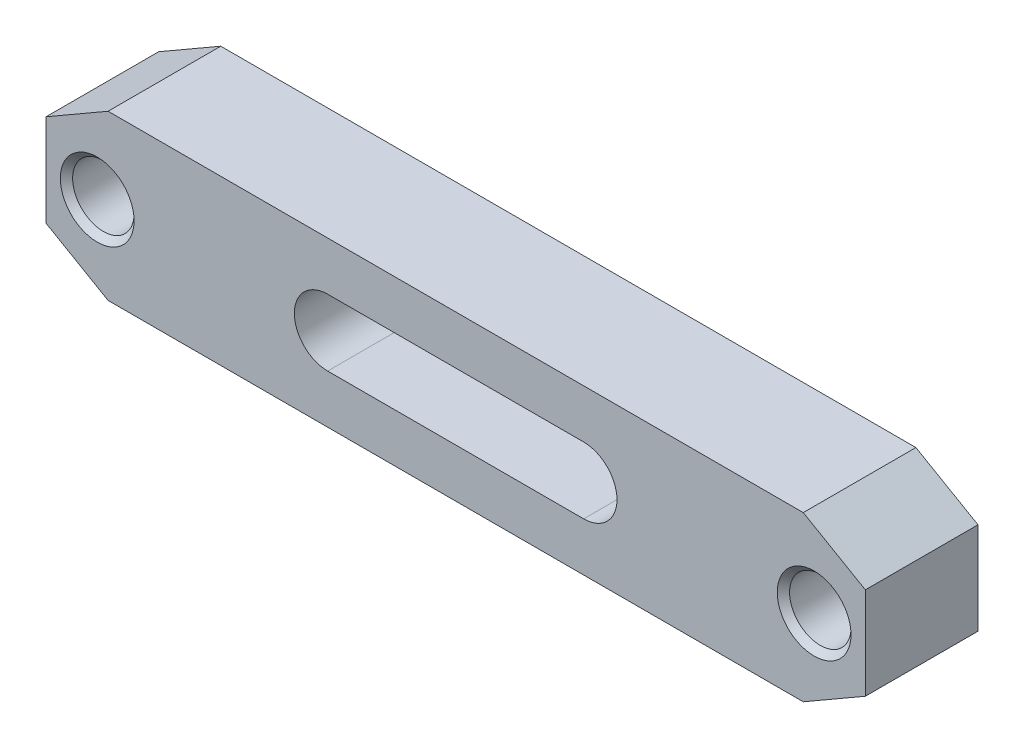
ISO-10303-21;
HEADER;
FILE_DESCRIPTION(('STEP AP214'),'2;1');
FILE_NAME('part.step','',(''),(''),'','','');
FILE_SCHEMA(('AUTOMOTIVE_DESIGN { 1 0 10303 214 1 1 1 1 }'));
ENDSEC;
DATA;
#1=APPLICATION_CONTEXT('core data for automotive mechanical design processes');
#2=APPLICATION_PROTOCOL_DEFINITION('international standard','automotive_design',2000,#1);
#3=PRODUCT_CONTEXT('',#1,'mechanical');
#4=PRODUCT('Part','Part','',(#3));
#5=PRODUCT_RELATED_PRODUCT_CATEGORY('part','',(#4));
#6=PRODUCT_DEFINITION_FORMATION('','',#4);
#7=PRODUCT_DEFINITION_CONTEXT('part definition',#1,'design');
#8=PRODUCT_DEFINITION('design','',#6,#7);
#9=PRODUCT_DEFINITION_SHAPE('','',#8);
#10=(LENGTH_UNIT() NAMED_UNIT(*) SI_UNIT(.MILLI.,.METRE.));
#11=(NAMED_UNIT(*) PLANE_ANGLE_UNIT() SI_UNIT($,.RADIAN.));
#12=(NAMED_UNIT(*) SI_UNIT($,.STERADIAN.) SOLID_ANGLE_UNIT());
#13=UNCERTAINTY_MEASURE_WITH_UNIT(LENGTH_MEASURE(1.E-05),#10,'distance_accuracy_value','');
#14=(GEOMETRIC_REPRESENTATION_CONTEXT(3) GLOBAL_UNCERTAINTY_ASSIGNED_CONTEXT((#13)) GLOBAL_UNIT_ASSIGNED_CONTEXT((#10,
#11,#12)) REPRESENTATION_CONTEXT('',''));
#15=CARTESIAN_POINT('',(0.,0.,0.));
#16=DIRECTION('',(0.,0.,1.));
#17=DIRECTION('',(1.,0.,0.));
#18=AXIS2_PLACEMENT_3D('',#15,#16,#17);
#19=CARTESIAN_POINT('',(80.,-16.,22.));
#20=DIRECTION('',(0.,0.,1.));
#21=DIRECTION('',(1.,0.,0.));
#22=AXIS2_PLACEMENT_3D('',#19,#20,#21);
#23=PLANE('',#22);
#24=CARTESIAN_POINT('',(70.,0.,22.));
#25=DIRECTION('',(0.,0.,-1.));
#26=DIRECTION('',(-1.,0.,0.));
#27=AXIS2_PLACEMENT_3D('',#24,#25,#26);
#28=CIRCLE('',#27,7.2);
#29=CARTESIAN_POINT('',(62.8,0.,22.));
#30=VERTEX_POINT('',#29);
#31=EDGE_CURVE('E212',#30,#30,#28,.T.);
#32=ORIENTED_EDGE('',*,*,#31,.T.);
#33=EDGE_LOOP('',(#32));
#34=FACE_BOUND('',#33,.T.);
#35=CARTESIAN_POINT('',(-70.,0.,22.));
#36=DIRECTION('',(0.,0.,-1.));
#37=DIRECTION('',(-1.,0.,0.));
#38=AXIS2_PLACEMENT_3D('',#35,#36,#37);
#39=CIRCLE('',#38,7.2);
#40=CARTESIAN_POINT('',(-77.2,0.,22.));
#41=VERTEX_POINT('',#40);
#42=EDGE_CURVE('E133',#41,#41,#39,.T.);
#43=ORIENTED_EDGE('',*,*,#42,.T.);
#44=EDGE_LOOP('',(#43));
#45=FACE_BOUND('',#44,.T.);
#46=DIRECTION('',(1.,0.,0.));
#47=VECTOR('',#46,1.);
#48=CARTESIAN_POINT('',(-67.875644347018,-16.,22.));
#49=LINE('',#48,#47);
#50=CARTESIAN_POINT('',(-67.875644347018,-16.,22.));
#51=VERTEX_POINT('',#50);
#52=CARTESIAN_POINT('',(67.875644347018,-16.,22.));
#53=VERTEX_POINT('',#52);
#54=EDGE_CURVE('E143',#51,#53,#49,.T.);
#55=ORIENTED_EDGE('',*,*,#54,.T.);
#56=DIRECTION('',(0.866025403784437,0.5,0.));
#57=VECTOR('',#56,1.);
#58=CARTESIAN_POINT('',(67.875644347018,-16.,22.));
#59=LINE('',#58,#57);
#60=CARTESIAN_POINT('',(80.,-9.,22.));
#61=VERTEX_POINT('',#60);
#62=EDGE_CURVE('E146',#53,#61,#59,.T.);
#63=ORIENTED_EDGE('',*,*,#62,.T.);
#64=DIRECTION('',(0.,1.,0.));
#65=VECTOR('',#64,1.);
#66=CARTESIAN_POINT('',(80.,-9.,22.));
#67=LINE('',#66,#65);
#68=CARTESIAN_POINT('',(80.,9.,22.));
#69=VERTEX_POINT('',#68);
#70=EDGE_CURVE('E149',#61,#69,#67,.T.);
#71=ORIENTED_EDGE('',*,*,#70,.T.);
#72=DIRECTION('',(-0.866025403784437,0.5,0.));
#73=VECTOR('',#72,1.);
#74=CARTESIAN_POINT('',(67.875644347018,16.,22.));
#75=LINE('',#74,#73);
#76=CARTESIAN_POINT('',(67.875644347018,16.,22.));
#77=VERTEX_POINT('',#76);
#78=EDGE_CURVE('E151',#69,#77,#75,.T.);
#79=ORIENTED_EDGE('',*,*,#78,.T.);
#80=DIRECTION('',(-1.,0.,0.));
#81=VECTOR('',#80,1.);
#82=CARTESIAN_POINT('',(-67.875644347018,16.,22.));
#83=LINE('',#82,#81);
#84=CARTESIAN_POINT('',(-67.875644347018,16.,22.));
#85=VERTEX_POINT('',#84);
#86=EDGE_CURVE('E153',#77,#85,#83,.T.);
#87=ORIENTED_EDGE('',*,*,#86,.T.);
#88=DIRECTION('',(-0.866025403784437,-0.5,0.));
#89=VECTOR('',#88,1.);
#90=CARTESIAN_POINT('',(-67.875644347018,16.,22.));
#91=LINE('',#90,#89);
#92=CARTESIAN_POINT('',(-80.,9.,22.));
#93=VERTEX_POINT('',#92);
#94=EDGE_CURVE('E155',#85,#93,#91,.T.);
#95=ORIENTED_EDGE('',*,*,#94,.T.);
#96=DIRECTION('',(0.,-1.,0.));
#97=VECTOR('',#96,1.);
#98=CARTESIAN_POINT('',(-80.,-9.,22.));
#99=LINE('',#98,#97);
#100=CARTESIAN_POINT('',(-80.,-9.,22.));
#101=VERTEX_POINT('',#100);
#102=EDGE_CURVE('E157',#93,#101,#99,.T.);
#103=ORIENTED_EDGE('',*,*,#102,.T.);
#104=DIRECTION('',(0.866025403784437,-0.5,0.));
#105=VECTOR('',#104,1.);
#106=CARTESIAN_POINT('',(-67.875644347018,-16.,22.));
#107=LINE('',#106,#105);
#108=EDGE_CURVE('E159',#101,#51,#107,.T.);
#109=ORIENTED_EDGE('',*,*,#108,.T.);
#110=EDGE_LOOP('',(#55,#63,#71,#79,#87,#95,#103,#109));
#111=FACE_BOUND('',#110,.T.);
#112=DIRECTION('',(-1.,0.,0.));
#113=VECTOR('',#112,1.);
#114=CARTESIAN_POINT('',(25.,6.5,22.));
#115=LINE('',#114,#113);
#116=CARTESIAN_POINT('',(25.,6.5,22.));
#117=VERTEX_POINT('',#116);
#118=CARTESIAN_POINT('',(-25.,6.5,22.));
#119=VERTEX_POINT('',#118);
#120=EDGE_CURVE('E113',#117,#119,#115,.T.);
#121=ORIENTED_EDGE('',*,*,#120,.F.);
#122=CARTESIAN_POINT('',(25.,0.,22.));
#123=DIRECTION('',(0.,0.,1.));
#124=DIRECTION('',(1.,0.,0.));
#125=AXIS2_PLACEMENT_3D('',#122,#123,#124);
#126=CIRCLE('',#125,6.5);
#127=CARTESIAN_POINT('',(25.,-6.5,22.));
#128=VERTEX_POINT('',#127);
#129=EDGE_CURVE('E105',#128,#117,#126,.T.);
#130=ORIENTED_EDGE('',*,*,#129,.F.);
#131=DIRECTION('',(1.,0.,0.));
#132=VECTOR('',#131,1.);
#133=CARTESIAN_POINT('',(25.,-6.5,22.));
#134=LINE('',#133,#132);
#135=CARTESIAN_POINT('',(-25.,-6.5,22.));
#136=VERTEX_POINT('',#135);
#137=EDGE_CURVE('E127',#136,#128,#134,.T.);
#138=ORIENTED_EDGE('',*,*,#137,.F.);
#139=CARTESIAN_POINT('',(-25.,0.,22.));
#140=DIRECTION('',(0.,0.,1.));
#141=DIRECTION('',(1.,0.,0.));
#142=AXIS2_PLACEMENT_3D('',#139,#140,#141);
#143=CIRCLE('',#142,6.5);
#144=EDGE_CURVE('E125',#119,#136,#143,.T.);
#145=ORIENTED_EDGE('',*,*,#144,.F.);
#146=EDGE_LOOP('',(#121,#130,#138,#145));
#147=FACE_BOUND('',#146,.T.);
#148=ADVANCED_FACE('F14',(#34,#45,#111,#147),#23,.T.);
#149=CARTESIAN_POINT('',(80.,-16.,0.));
#150=DIRECTION('',(0.,0.,1.));
#151=DIRECTION('',(1.,0.,0.));
#152=AXIS2_PLACEMENT_3D('',#149,#150,#151);
#153=PLANE('',#152);
#154=CARTESIAN_POINT('',(70.,0.,0.));
#155=DIRECTION('',(0.,0.,-1.));
#156=DIRECTION('',(-1.,0.,0.));
#157=AXIS2_PLACEMENT_3D('',#154,#155,#156);
#158=CIRCLE('',#157,7.2);
#159=CARTESIAN_POINT('',(62.8,0.,0.));
#160=VERTEX_POINT('',#159);
#161=EDGE_CURVE('E202',#160,#160,#158,.T.);
#162=ORIENTED_EDGE('',*,*,#161,.F.);
#163=EDGE_LOOP('',(#162));
#164=FACE_BOUND('',#163,.T.);
#165=CARTESIAN_POINT('',(-70.,0.,0.));
#166=DIRECTION('',(0.,0.,-1.));
#167=DIRECTION('',(-1.,0.,0.));
#168=AXIS2_PLACEMENT_3D('',#165,#166,#167);
#169=CIRCLE('',#168,7.2);
#170=CARTESIAN_POINT('',(-77.2,0.,0.));
#171=VERTEX_POINT('',#170);
#172=EDGE_CURVE('E215',#171,#171,#169,.T.);
#173=ORIENTED_EDGE('',*,*,#172,.F.);
#174=EDGE_LOOP('',(#173));
#175=FACE_BOUND('',#174,.T.);
#176=DIRECTION('',(1.,0.,0.));
#177=VECTOR('',#176,1.);
#178=CARTESIAN_POINT('',(-67.875644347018,-16.,0.));
#179=LINE('',#178,#177);
#180=CARTESIAN_POINT('',(-67.875644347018,-16.,0.));
#181=VERTEX_POINT('',#180);
#182=CARTESIAN_POINT('',(67.875644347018,-16.,0.));
#183=VERTEX_POINT('',#182);
#184=EDGE_CURVE('E121',#181,#183,#179,.T.);
#185=ORIENTED_EDGE('',*,*,#184,.F.);
#186=DIRECTION('',(0.866025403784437,-0.5,0.));
#187=VECTOR('',#186,1.);
#188=CARTESIAN_POINT('',(-67.875644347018,-16.,0.));
#189=LINE('',#188,#187);
#190=CARTESIAN_POINT('',(-80.,-9.,0.));
#191=VERTEX_POINT('',#190);
#192=EDGE_CURVE('E147',#191,#181,#189,.T.);
#193=ORIENTED_EDGE('',*,*,#192,.F.);
#194=DIRECTION('',(0.,-1.,0.));
#195=VECTOR('',#194,1.);
#196=CARTESIAN_POINT('',(-80.,-9.,0.));
#197=LINE('',#196,#195);
#198=CARTESIAN_POINT('',(-80.,9.,0.));
#199=VERTEX_POINT('',#198);
#200=EDGE_CURVE('E174',#199,#191,#197,.T.);
#201=ORIENTED_EDGE('',*,*,#200,.F.);
#202=DIRECTION('',(-0.866025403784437,-0.5,0.));
#203=VECTOR('',#202,1.);
#204=CARTESIAN_POINT('',(-67.875644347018,16.,0.));
#205=LINE('',#204,#203);
#206=CARTESIAN_POINT('',(-67.875644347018,16.,0.));
#207=VERTEX_POINT('',#206);
#208=EDGE_CURVE('E172',#207,#199,#205,.T.);
#209=ORIENTED_EDGE('',*,*,#208,.F.);
#210=DIRECTION('',(-1.,0.,0.));
#211=VECTOR('',#210,1.);
#212=CARTESIAN_POINT('',(-67.875644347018,16.,0.));
#213=LINE('',#212,#211);
#214=CARTESIAN_POINT('',(67.875644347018,16.,0.));
#215=VERTEX_POINT('',#214);
#216=EDGE_CURVE('E170',#215,#207,#213,.T.);
#217=ORIENTED_EDGE('',*,*,#216,.F.);
#218=DIRECTION('',(-0.866025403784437,0.5,0.));
#219=VECTOR('',#218,1.);
#220=CARTESIAN_POINT('',(67.875644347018,16.,0.));
#221=LINE('',#220,#219);
#222=CARTESIAN_POINT('',(80.,9.,0.));
#223=VERTEX_POINT('',#222);
#224=EDGE_CURVE('E168',#223,#215,#221,.T.);
#225=ORIENTED_EDGE('',*,*,#224,.F.);
#226=DIRECTION('',(0.,1.,0.));
#227=VECTOR('',#226,1.);
#228=CARTESIAN_POINT('',(80.,-9.,0.));
#229=LINE('',#228,#227);
#230=CARTESIAN_POINT('',(80.,-9.,0.));
#231=VERTEX_POINT('',#230);
#232=EDGE_CURVE('E166',#231,#223,#229,.T.);
#233=ORIENTED_EDGE('',*,*,#232,.F.);
#234=DIRECTION('',(0.866025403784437,0.5,0.));
#235=VECTOR('',#234,1.);
#236=CARTESIAN_POINT('',(67.875644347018,-16.,0.));
#237=LINE('',#236,#235);
#238=EDGE_CURVE('E164',#183,#231,#237,.T.);
#239=ORIENTED_EDGE('',*,*,#238,.F.);
#240=EDGE_LOOP('',(#185,#193,#201,#209,#217,#225,#233,#239));
#241=FACE_BOUND('',#240,.T.);
#242=CARTESIAN_POINT('',(25.,0.,0.));
#243=DIRECTION('',(0.,0.,1.));
#244=DIRECTION('',(1.,0.,0.));
#245=AXIS2_PLACEMENT_3D('',#242,#243,#244);
#246=CIRCLE('',#245,6.5);
#247=CARTESIAN_POINT('',(25.,-6.5,0.));
#248=VERTEX_POINT('',#247);
#249=CARTESIAN_POINT('',(25.,6.5,0.));
#250=VERTEX_POINT('',#249);
#251=EDGE_CURVE('E39',#248,#250,#246,.T.);
#252=ORIENTED_EDGE('',*,*,#251,.T.);
#253=DIRECTION('',(-1.,0.,0.));
#254=VECTOR('',#253,1.);
#255=CARTESIAN_POINT('',(25.,6.5,0.));
#256=LINE('',#255,#254);
#257=CARTESIAN_POINT('',(-25.,6.5,0.));
#258=VERTEX_POINT('',#257);
#259=EDGE_CURVE('E120',#250,#258,#256,.T.);
#260=ORIENTED_EDGE('',*,*,#259,.T.);
#261=CARTESIAN_POINT('',(-25.,0.,0.));
#262=DIRECTION('',(0.,0.,1.));
#263=DIRECTION('',(1.,0.,0.));
#264=AXIS2_PLACEMENT_3D('',#261,#262,#263);
#265=CIRCLE('',#264,6.5);
#266=CARTESIAN_POINT('',(-25.,-6.5,0.));
#267=VERTEX_POINT('',#266);
#268=EDGE_CURVE('E135',#258,#267,#265,.T.);
#269=ORIENTED_EDGE('',*,*,#268,.T.);
#270=DIRECTION('',(1.,0.,0.));
#271=VECTOR('',#270,1.);
#272=CARTESIAN_POINT('',(25.,-6.5,0.));
#273=LINE('',#272,#271);
#274=EDGE_CURVE('E114',#267,#248,#273,.T.);
#275=ORIENTED_EDGE('',*,*,#274,.T.);
#276=EDGE_LOOP('',(#252,#260,#269,#275));
#277=FACE_BOUND('',#276,.T.);
#278=ADVANCED_FACE('F238',(#164,#175,#241,#277),#153,.F.);
#279=CARTESIAN_POINT('',(-67.875644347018,-16.,22.));
#280=DIRECTION('',(0.,1.,0.));
#281=DIRECTION('',(-1.,0.,0.));
#282=AXIS2_PLACEMENT_3D('',#279,#280,#281);
#283=PLANE('',#282);
#284=ORIENTED_EDGE('',*,*,#184,.T.);
#285=DIRECTION('',(0.,0.,-1.));
#286=VECTOR('',#285,1.);
#287=CARTESIAN_POINT('',(67.875644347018,-16.,22.));
#288=LINE('',#287,#286);
#289=EDGE_CURVE('E9',#53,#183,#288,.T.);
#290=ORIENTED_EDGE('',*,*,#289,.F.);
#291=ORIENTED_EDGE('',*,*,#54,.F.);
#292=DIRECTION('',(0.,0.,-1.));
#293=VECTOR('',#292,1.);
#294=CARTESIAN_POINT('',(-67.875644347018,-16.,22.));
#295=LINE('',#294,#293);
#296=EDGE_CURVE('E161',#51,#181,#295,.T.);
#297=ORIENTED_EDGE('',*,*,#296,.T.);
#298=EDGE_LOOP('',(#284,#290,#291,#297));
#299=FACE_BOUND('',#298,.T.);
#300=ADVANCED_FACE('F16',(#299),#283,.F.);
#301=CARTESIAN_POINT('',(67.875644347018,-16.,22.));
#302=DIRECTION('',(-0.5,0.866025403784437,0.));
#303=DIRECTION('',(-0.866025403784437,-0.5,0.));
#304=AXIS2_PLACEMENT_3D('',#301,#302,#303);
#305=PLANE('',#304);
#306=ORIENTED_EDGE('',*,*,#238,.T.);
#307=DIRECTION('',(0.,0.,-1.));
#308=VECTOR('',#307,1.);
#309=CARTESIAN_POINT('',(80.,-9.,22.));
#310=LINE('',#309,#308);
#311=EDGE_CURVE('E23',#61,#231,#310,.T.);
#312=ORIENTED_EDGE('',*,*,#311,.F.);
#313=ORIENTED_EDGE('',*,*,#62,.F.);
#314=ORIENTED_EDGE('',*,*,#289,.T.);
#315=EDGE_LOOP('',(#306,#312,#313,#314));
#316=FACE_BOUND('',#315,.T.);
#317=ADVANCED_FACE('F271',(#316),#305,.F.);
#318=CARTESIAN_POINT('',(80.,-9.,22.));
#319=DIRECTION('',(-1.,0.,0.));
#320=DIRECTION('',(0.,0.,1.));
#321=AXIS2_PLACEMENT_3D('',#318,#319,#320);
#322=PLANE('',#321);
#323=ORIENTED_EDGE('',*,*,#232,.T.);
#324=DIRECTION('',(0.,0.,-1.));
#325=VECTOR('',#324,1.);
#326=CARTESIAN_POINT('',(80.,9.,22.));
#327=LINE('',#326,#325);
#328=EDGE_CURVE('E191',#69,#223,#327,.T.);
#329=ORIENTED_EDGE('',*,*,#328,.F.);
#330=ORIENTED_EDGE('',*,*,#70,.F.);
#331=ORIENTED_EDGE('',*,*,#311,.T.);
#332=EDGE_LOOP('',(#323,#329,#330,#331));
#333=FACE_BOUND('',#332,.T.);
#334=ADVANCED_FACE('F268',(#333),#322,.F.);
#335=CARTESIAN_POINT('',(67.875644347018,16.,22.));
#336=DIRECTION('',(-0.5,-0.866025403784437,0.));
#337=DIRECTION('',(0.866025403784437,-0.5,0.));
#338=AXIS2_PLACEMENT_3D('',#335,#336,#337);
#339=PLANE('',#338);
#340=ORIENTED_EDGE('',*,*,#224,.T.);
#341=DIRECTION('',(0.,0.,-1.));
#342=VECTOR('',#341,1.);
#343=CARTESIAN_POINT('',(67.875644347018,16.,22.));
#344=LINE('',#343,#342);
#345=EDGE_CURVE('E188',#77,#215,#344,.T.);
#346=ORIENTED_EDGE('',*,*,#345,.F.);
#347=ORIENTED_EDGE('',*,*,#78,.F.);
#348=ORIENTED_EDGE('',*,*,#328,.T.);
#349=EDGE_LOOP('',(#340,#346,#347,#348));
#350=FACE_BOUND('',#349,.T.);
#351=ADVANCED_FACE('F264',(#350),#339,.F.);
#352=CARTESIAN_POINT('',(-67.875644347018,16.,22.));
#353=DIRECTION('',(0.,-1.,0.));
#354=DIRECTION('',(0.,0.,-1.));
#355=AXIS2_PLACEMENT_3D('',#352,#353,#354);
#356=PLANE('',#355);
#357=ORIENTED_EDGE('',*,*,#216,.T.);
#358=DIRECTION('',(0.,0.,-1.));
#359=VECTOR('',#358,1.);
#360=CARTESIAN_POINT('',(-67.875644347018,16.,22.));
#361=LINE('',#360,#359);
#362=EDGE_CURVE('E185',#85,#207,#361,.T.);
#363=ORIENTED_EDGE('',*,*,#362,.F.);
#364=ORIENTED_EDGE('',*,*,#86,.F.);
#365=ORIENTED_EDGE('',*,*,#345,.T.);
#366=EDGE_LOOP('',(#357,#363,#364,#365));
#367=FACE_BOUND('',#366,.T.);
#368=ADVANCED_FACE('F260',(#367),#356,.F.);
#369=CARTESIAN_POINT('',(-67.875644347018,16.,22.));
#370=DIRECTION('',(0.5,-0.866025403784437,0.));
#371=DIRECTION('',(0.866025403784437,0.5,0.));
#372=AXIS2_PLACEMENT_3D('',#369,#370,#371);
#373=PLANE('',#372);
#374=ORIENTED_EDGE('',*,*,#208,.T.);
#375=DIRECTION('',(0.,0.,-1.));
#376=VECTOR('',#375,1.);
#377=CARTESIAN_POINT('',(-80.,9.,22.));
#378=LINE('',#377,#376);
#379=EDGE_CURVE('E182',#93,#199,#378,.T.);
#380=ORIENTED_EDGE('',*,*,#379,.F.);
#381=ORIENTED_EDGE('',*,*,#94,.F.);
#382=ORIENTED_EDGE('',*,*,#362,.T.);
#383=EDGE_LOOP('',(#374,#380,#381,#382));
#384=FACE_BOUND('',#383,.T.);
#385=ADVANCED_FACE('F256',(#384),#373,.F.);
#386=CARTESIAN_POINT('',(-80.,-9.,22.));
#387=DIRECTION('',(1.,0.,0.));
#388=DIRECTION('',(0.,0.,-1.));
#389=AXIS2_PLACEMENT_3D('',#386,#387,#388);
#390=PLANE('',#389);
#391=ORIENTED_EDGE('',*,*,#200,.T.);
#392=DIRECTION('',(0.,0.,-1.));
#393=VECTOR('',#392,1.);
#394=CARTESIAN_POINT('',(-80.,-9.,22.));
#395=LINE('',#394,#393);
#396=EDGE_CURVE('E179',#101,#191,#395,.T.);
#397=ORIENTED_EDGE('',*,*,#396,.F.);
#398=ORIENTED_EDGE('',*,*,#102,.F.);
#399=ORIENTED_EDGE('',*,*,#379,.T.);
#400=EDGE_LOOP('',(#391,#397,#398,#399));
#401=FACE_BOUND('',#400,.T.);
#402=ADVANCED_FACE('F252',(#401),#390,.F.);
#403=CARTESIAN_POINT('',(-67.875644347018,-16.,22.));
#404=DIRECTION('',(0.5,0.866025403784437,0.));
#405=DIRECTION('',(-0.866025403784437,0.5,0.));
#406=AXIS2_PLACEMENT_3D('',#403,#404,#405);
#407=PLANE('',#406);
#408=ORIENTED_EDGE('',*,*,#192,.T.);
#409=ORIENTED_EDGE('',*,*,#296,.F.);
#410=ORIENTED_EDGE('',*,*,#108,.F.);
#411=ORIENTED_EDGE('',*,*,#396,.T.);
#412=EDGE_LOOP('',(#408,#409,#410,#411));
#413=FACE_BOUND('',#412,.T.);
#414=ADVANCED_FACE('F249',(#413),#407,.F.);
#415=CARTESIAN_POINT('',(25.,0.,22.));
#416=DIRECTION('',(0.,0.,-1.));
#417=DIRECTION('',(-1.,0.,0.));
#418=AXIS2_PLACEMENT_3D('',#415,#416,#417);
#419=CYLINDRICAL_SURFACE('',#418,6.5);
#420=ORIENTED_EDGE('',*,*,#251,.F.);
#421=DIRECTION('',(0.,0.,-1.));
#422=VECTOR('',#421,1.);
#423=CARTESIAN_POINT('',(25.,-6.5,22.));
#424=LINE('',#423,#422);
#425=EDGE_CURVE('E109',#128,#248,#424,.T.);
#426=ORIENTED_EDGE('',*,*,#425,.F.);
#427=ORIENTED_EDGE('',*,*,#129,.T.);
#428=DIRECTION('',(0.,0.,-1.));
#429=VECTOR('',#428,1.);
#430=CARTESIAN_POINT('',(25.,6.5,22.));
#431=LINE('',#430,#429);
#432=EDGE_CURVE('E108',#117,#250,#431,.T.);
#433=ORIENTED_EDGE('',*,*,#432,.T.);
#434=EDGE_LOOP('',(#420,#426,#427,#433));
#435=FACE_BOUND('',#434,.T.);
#436=ADVANCED_FACE('F107',(#435),#419,.F.);
#437=CARTESIAN_POINT('',(25.,6.5,22.));
#438=DIRECTION('',(0.,-1.,0.));
#439=DIRECTION('',(1.,0.,0.));
#440=AXIS2_PLACEMENT_3D('',#437,#438,#439);
#441=PLANE('',#440);
#442=ORIENTED_EDGE('',*,*,#259,.F.);
#443=ORIENTED_EDGE('',*,*,#432,.F.);
#444=ORIENTED_EDGE('',*,*,#120,.T.);
#445=DIRECTION('',(0.,0.,-1.));
#446=VECTOR('',#445,1.);
#447=CARTESIAN_POINT('',(-25.,6.5,22.));
#448=LINE('',#447,#446);
#449=EDGE_CURVE('E122',#119,#258,#448,.T.);
#450=ORIENTED_EDGE('',*,*,#449,.T.);
#451=EDGE_LOOP('',(#442,#443,#444,#450));
#452=FACE_BOUND('',#451,.T.);
#453=ADVANCED_FACE('F117',(#452),#441,.T.);
#454=CARTESIAN_POINT('',(-25.,0.,22.));
#455=DIRECTION('',(0.,0.,-1.));
#456=DIRECTION('',(-1.,0.,0.));
#457=AXIS2_PLACEMENT_3D('',#454,#455,#456);
#458=CYLINDRICAL_SURFACE('',#457,6.5);
#459=ORIENTED_EDGE('',*,*,#268,.F.);
#460=ORIENTED_EDGE('',*,*,#449,.F.);
#461=ORIENTED_EDGE('',*,*,#144,.T.);
#462=DIRECTION('',(0.,0.,-1.));
#463=VECTOR('',#462,1.);
#464=CARTESIAN_POINT('',(-25.,-6.5,22.));
#465=LINE('',#464,#463);
#466=EDGE_CURVE('E31',#136,#267,#465,.T.);
#467=ORIENTED_EDGE('',*,*,#466,.T.);
#468=EDGE_LOOP('',(#459,#460,#461,#467));
#469=FACE_BOUND('',#468,.T.);
#470=ADVANCED_FACE('F235',(#469),#458,.F.);
#471=CARTESIAN_POINT('',(25.,-6.5,22.));
#472=DIRECTION('',(0.,1.,0.));
#473=DIRECTION('',(-1.,0.,0.));
#474=AXIS2_PLACEMENT_3D('',#471,#472,#473);
#475=PLANE('',#474);
#476=ORIENTED_EDGE('',*,*,#274,.F.);
#477=ORIENTED_EDGE('',*,*,#466,.F.);
#478=ORIENTED_EDGE('',*,*,#137,.T.);
#479=ORIENTED_EDGE('',*,*,#425,.T.);
#480=EDGE_LOOP('',(#476,#477,#478,#479));
#481=FACE_BOUND('',#480,.T.);
#482=ADVANCED_FACE('F225',(#481),#475,.T.);
#483=CARTESIAN_POINT('',(-70.,0.,20.));
#484=DIRECTION('',(0.,0.,1.));
#485=DIRECTION('',(1.,0.,0.));
#486=AXIS2_PLACEMENT_3D('',#483,#484,#485);
#487=CONICAL_SURFACE('',#486,5.2,0.785398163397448);
#488=CARTESIAN_POINT('',(-70.,0.,20.8));
#489=DIRECTION('',(0.,0.,1.));
#490=DIRECTION('',(1.,0.,0.));
#491=AXIS2_PLACEMENT_3D('',#488,#489,#490);
#492=CIRCLE('',#491,6.);
#493=CARTESIAN_POINT('',(-64.,0.,20.8));
#494=VERTEX_POINT('',#493);
#495=EDGE_CURVE('E197',#494,#494,#492,.F.);
#496=ORIENTED_EDGE('',*,*,#495,.T.);
#497=EDGE_LOOP('',(#496));
#498=FACE_BOUND('',#497,.T.);
#499=ORIENTED_EDGE('',*,*,#42,.F.);
#500=EDGE_LOOP('',(#499));
#501=FACE_BOUND('',#500,.T.);
#502=ADVANCED_FACE('F222',(#498,#501),#487,.F.);
#503=CARTESIAN_POINT('',(-70.,0.,0.));
#504=DIRECTION('',(0.,0.,-1.));
#505=DIRECTION('',(-1.,0.,0.));
#506=AXIS2_PLACEMENT_3D('',#503,#504,#505);
#507=CONICAL_SURFACE('',#506,7.2,0.785398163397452);
#508=CARTESIAN_POINT('',(-70.,0.,1.19999999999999));
#509=DIRECTION('',(0.,0.,-1.));
#510=DIRECTION('',(-1.,0.,0.));
#511=AXIS2_PLACEMENT_3D('',#508,#509,#510);
#512=CIRCLE('',#511,6.);
#513=CARTESIAN_POINT('',(-76.,0.,1.19999999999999));
#514=VERTEX_POINT('',#513);
#515=EDGE_CURVE('E195',#514,#514,#512,.F.);
#516=ORIENTED_EDGE('',*,*,#515,.T.);
#517=EDGE_LOOP('',(#516));
#518=FACE_BOUND('',#517,.T.);
#519=ORIENTED_EDGE('',*,*,#172,.T.);
#520=EDGE_LOOP('',(#519));
#521=FACE_BOUND('',#520,.T.);
#522=ADVANCED_FACE('F224',(#518,#521),#507,.F.);
#523=CARTESIAN_POINT('',(70.,0.,20.));
#524=DIRECTION('',(0.,0.,1.));
#525=DIRECTION('',(1.,0.,0.));
#526=AXIS2_PLACEMENT_3D('',#523,#524,#525);
#527=CONICAL_SURFACE('',#526,5.2,0.785398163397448);
#528=CARTESIAN_POINT('',(70.,0.,20.8));
#529=DIRECTION('',(0.,0.,1.));
#530=DIRECTION('',(1.,0.,0.));
#531=AXIS2_PLACEMENT_3D('',#528,#529,#530);
#532=CIRCLE('',#531,6.);
#533=CARTESIAN_POINT('',(76.,0.,20.8));
#534=VERTEX_POINT('',#533);
#535=EDGE_CURVE('E198',#534,#534,#532,.F.);
#536=ORIENTED_EDGE('',*,*,#535,.T.);
#537=EDGE_LOOP('',(#536));
#538=FACE_BOUND('',#537,.T.);
#539=ORIENTED_EDGE('',*,*,#31,.F.);
#540=EDGE_LOOP('',(#539));
#541=FACE_BOUND('',#540,.T.);
#542=ADVANCED_FACE('F233',(#538,#541),#527,.F.);
#543=CARTESIAN_POINT('',(70.,0.,0.));
#544=DIRECTION('',(0.,0.,-1.));
#545=DIRECTION('',(-1.,0.,0.));
#546=AXIS2_PLACEMENT_3D('',#543,#544,#545);
#547=CONICAL_SURFACE('',#546,7.2,0.785398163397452);
#548=CARTESIAN_POINT('',(70.,0.,1.19999999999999));
#549=DIRECTION('',(0.,0.,-1.));
#550=DIRECTION('',(-1.,0.,0.));
#551=AXIS2_PLACEMENT_3D('',#548,#549,#550);
#552=CIRCLE('',#551,6.);
#553=CARTESIAN_POINT('',(64.,0.,1.19999999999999));
#554=VERTEX_POINT('',#553);
#555=EDGE_CURVE('E18',#554,#554,#552,.F.);
#556=ORIENTED_EDGE('',*,*,#555,.T.);
#557=EDGE_LOOP('',(#556));
#558=FACE_BOUND('',#557,.T.);
#559=ORIENTED_EDGE('',*,*,#161,.T.);
#560=EDGE_LOOP('',(#559));
#561=FACE_BOUND('',#560,.T.);
#562=ADVANCED_FACE('F398',(#558,#561),#547,.F.);
#563=CARTESIAN_POINT('',(-70.,0.,0.));
#564=DIRECTION('',(0.,0.,1.));
#565=DIRECTION('',(1.,0.,0.));
#566=AXIS2_PLACEMENT_3D('',#563,#564,#565);
#567=CYLINDRICAL_SURFACE('',#566,6.);
#568=ORIENTED_EDGE('',*,*,#515,.F.);
#569=EDGE_LOOP('',(#568));
#570=FACE_BOUND('',#569,.T.);
#571=ORIENTED_EDGE('',*,*,#495,.F.);
#572=EDGE_LOOP('',(#571));
#573=FACE_BOUND('',#572,.T.);
#574=ADVANCED_FACE('F407',(#570,#573),#567,.F.);
#575=CARTESIAN_POINT('',(70.,0.,0.));
#576=DIRECTION('',(0.,0.,1.));
#577=DIRECTION('',(1.,0.,0.));
#578=AXIS2_PLACEMENT_3D('',#575,#576,#577);
#579=CYLINDRICAL_SURFACE('',#578,6.);
#580=ORIENTED_EDGE('',*,*,#555,.F.);
#581=EDGE_LOOP('',(#580));
#582=FACE_BOUND('',#581,.T.);
#583=ORIENTED_EDGE('',*,*,#535,.F.);
#584=EDGE_LOOP('',(#583));
#585=FACE_BOUND('',#584,.T.);
#586=ADVANCED_FACE('F417',(#582,#585),#579,.F.);
#587=CLOSED_SHELL('',(#148,#278,#300,#317,#334,#351,#368,#385,#402,#414,#436,#453,#470,#482,
#502,#522,#542,#562,#574,#586));
#588=MANIFOLD_SOLID_BREP('B1',#587);
#589=ADVANCED_BREP_SHAPE_REPRESENTATION('',(#18,#588),#14);
#590=SHAPE_DEFINITION_REPRESENTATION(#9,#589);
ENDSEC;
END-ISO-10303-21;
